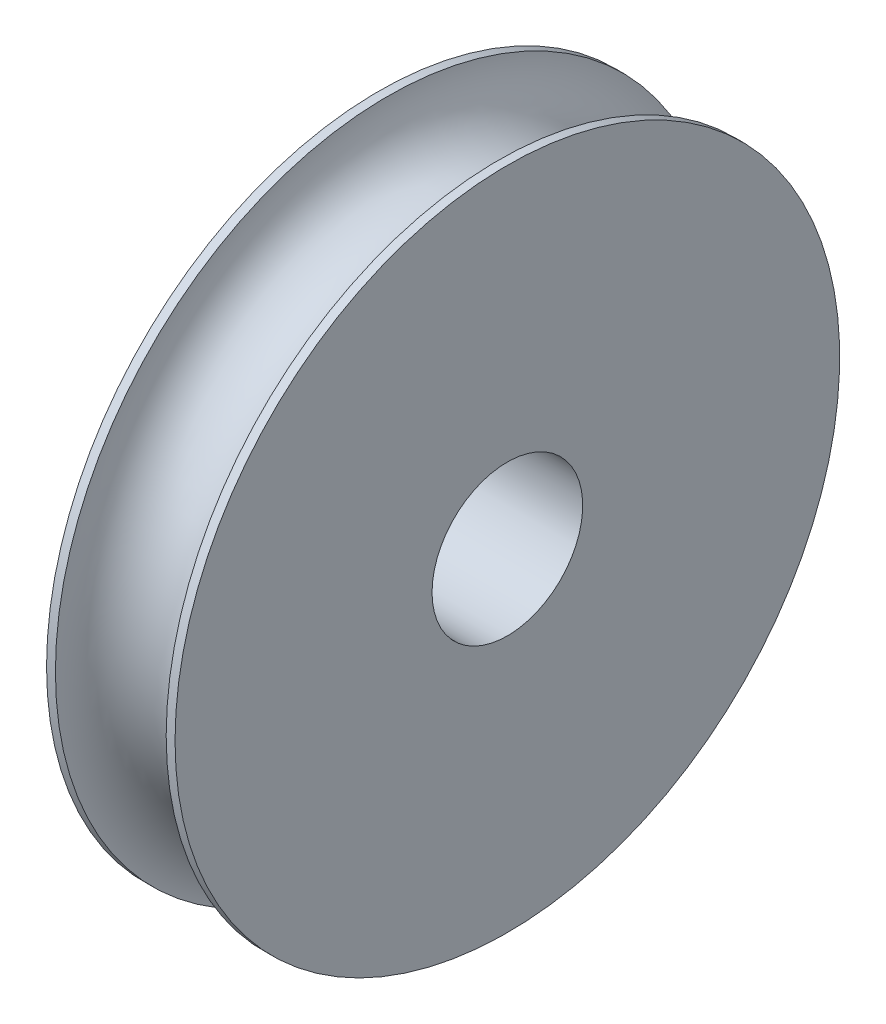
ISO-10303-21;
HEADER;
FILE_DESCRIPTION(('STEP AP214'),'2;1');
FILE_NAME('part.step','',(''),(''),'','','');
FILE_SCHEMA(('AUTOMOTIVE_DESIGN { 1 0 10303 214 1 1 1 1 }'));
ENDSEC;
DATA;
#1=APPLICATION_CONTEXT('core data for automotive mechanical design processes');
#2=APPLICATION_PROTOCOL_DEFINITION('international standard','automotive_design',2000,#1);
#3=PRODUCT_CONTEXT('',#1,'mechanical');
#4=PRODUCT('Part','Part','',(#3));
#5=PRODUCT_RELATED_PRODUCT_CATEGORY('part','',(#4));
#6=PRODUCT_DEFINITION_FORMATION('','',#4);
#7=PRODUCT_DEFINITION_CONTEXT('part definition',#1,'design');
#8=PRODUCT_DEFINITION('design','',#6,#7);
#9=PRODUCT_DEFINITION_SHAPE('','',#8);
#10=(LENGTH_UNIT() NAMED_UNIT(*) SI_UNIT(.MILLI.,.METRE.));
#11=(NAMED_UNIT(*) PLANE_ANGLE_UNIT() SI_UNIT($,.RADIAN.));
#12=(NAMED_UNIT(*) SI_UNIT($,.STERADIAN.) SOLID_ANGLE_UNIT());
#13=UNCERTAINTY_MEASURE_WITH_UNIT(LENGTH_MEASURE(1.E-05),#10,'distance_accuracy_value','');
#14=(GEOMETRIC_REPRESENTATION_CONTEXT(3) GLOBAL_UNCERTAINTY_ASSIGNED_CONTEXT((#13)) GLOBAL_UNIT_ASSIGNED_CONTEXT((#10,
#11,#12)) REPRESENTATION_CONTEXT('',''));
#15=CARTESIAN_POINT('',(0.,0.,0.));
#16=DIRECTION('',(0.,0.,1.));
#17=DIRECTION('',(1.,0.,0.));
#18=AXIS2_PLACEMENT_3D('',#15,#16,#17);
#19=CARTESIAN_POINT('',(0.,0.,0.));
#20=DIRECTION('',(-1.,0.,0.));
#21=DIRECTION('',(0.,0.,1.));
#22=AXIS2_PLACEMENT_3D('',#19,#20,#21);
#23=CYLINDRICAL_SURFACE('',#22,75.);
#24=CARTESIAN_POINT('',(0.,0.,0.));
#25=DIRECTION('',(-1.,0.,0.));
#26=DIRECTION('',(0.,0.,1.));
#27=AXIS2_PLACEMENT_3D('',#24,#25,#26);
#28=CIRCLE('',#27,75.);
#29=CARTESIAN_POINT('',(0.,0.,75.));
#30=VERTEX_POINT('',#29);
#31=EDGE_CURVE('E10',#30,#30,#28,.T.);
#32=ORIENTED_EDGE('',*,*,#31,.F.);
#33=EDGE_LOOP('',(#32));
#34=FACE_BOUND('',#33,.T.);
#35=CARTESIAN_POINT('',(2.,0.,0.));
#36=DIRECTION('',(-1.,0.,0.));
#37=DIRECTION('',(0.,0.,1.));
#38=AXIS2_PLACEMENT_3D('',#35,#36,#37);
#39=CIRCLE('',#38,75.);
#40=CARTESIAN_POINT('',(2.,0.,75.));
#41=VERTEX_POINT('',#40);
#42=EDGE_CURVE('E53',#41,#41,#39,.T.);
#43=ORIENTED_EDGE('',*,*,#42,.T.);
#44=EDGE_LOOP('',(#43));
#45=FACE_BOUND('',#44,.T.);
#46=ADVANCED_FACE('F31',(#34,#45),#23,.T.);
#47=CARTESIAN_POINT('',(0.,17.,0.));
#48=DIRECTION('',(1.,0.,0.));
#49=DIRECTION('',(0.,0.,-1.));
#50=AXIS2_PLACEMENT_3D('',#47,#48,#49);
#51=PLANE('',#50);
#52=CARTESIAN_POINT('',(0.,0.,0.));
#53=DIRECTION('',(-1.,0.,0.));
#54=DIRECTION('',(0.,0.,1.));
#55=AXIS2_PLACEMENT_3D('',#52,#53,#54);
#56=CIRCLE('',#55,17.);
#57=CARTESIAN_POINT('',(0.,0.,17.));
#58=VERTEX_POINT('',#57);
#59=EDGE_CURVE('E37',#58,#58,#56,.T.);
#60=ORIENTED_EDGE('',*,*,#59,.F.);
#61=EDGE_LOOP('',(#60));
#62=FACE_BOUND('',#61,.T.);
#63=ORIENTED_EDGE('',*,*,#31,.T.);
#64=EDGE_LOOP('',(#63));
#65=FACE_BOUND('',#64,.T.);
#66=ADVANCED_FACE('F78',(#62,#65),#51,.F.);
#67=CARTESIAN_POINT('',(0.,0.,0.));
#68=DIRECTION('',(-1.,0.,0.));
#69=DIRECTION('',(0.,0.,1.));
#70=AXIS2_PLACEMENT_3D('',#67,#68,#69);
#71=CYLINDRICAL_SURFACE('',#70,17.);
#72=CARTESIAN_POINT('',(29.,0.,0.));
#73=DIRECTION('',(-1.,0.,0.));
#74=DIRECTION('',(0.,0.,1.));
#75=AXIS2_PLACEMENT_3D('',#72,#73,#74);
#76=CIRCLE('',#75,17.);
#77=CARTESIAN_POINT('',(29.,0.,17.));
#78=VERTEX_POINT('',#77);
#79=EDGE_CURVE('E41',#78,#78,#76,.T.);
#80=ORIENTED_EDGE('',*,*,#79,.F.);
#81=EDGE_LOOP('',(#80));
#82=FACE_BOUND('',#81,.T.);
#83=ORIENTED_EDGE('',*,*,#59,.T.);
#84=EDGE_LOOP('',(#83));
#85=FACE_BOUND('',#84,.T.);
#86=ADVANCED_FACE('F73',(#82,#85),#71,.F.);
#87=CARTESIAN_POINT('',(29.,75.,0.));
#88=DIRECTION('',(-1.,0.,0.));
#89=DIRECTION('',(0.,0.,1.));
#90=AXIS2_PLACEMENT_3D('',#87,#88,#89);
#91=PLANE('',#90);
#92=CARTESIAN_POINT('',(29.,0.,0.));
#93=DIRECTION('',(-1.,0.,0.));
#94=DIRECTION('',(0.,0.,1.));
#95=AXIS2_PLACEMENT_3D('',#92,#93,#94);
#96=CIRCLE('',#95,75.);
#97=CARTESIAN_POINT('',(29.,0.,75.));
#98=VERTEX_POINT('',#97);
#99=EDGE_CURVE('E45',#98,#98,#96,.T.);
#100=ORIENTED_EDGE('',*,*,#99,.F.);
#101=EDGE_LOOP('',(#100));
#102=FACE_BOUND('',#101,.T.);
#103=ORIENTED_EDGE('',*,*,#79,.T.);
#104=EDGE_LOOP('',(#103));
#105=FACE_BOUND('',#104,.T.);
#106=ADVANCED_FACE('F67',(#102,#105),#91,.F.);
#107=CARTESIAN_POINT('',(0.,0.,0.));
#108=DIRECTION('',(-1.,0.,0.));
#109=DIRECTION('',(0.,0.,1.));
#110=AXIS2_PLACEMENT_3D('',#107,#108,#109);
#111=CYLINDRICAL_SURFACE('',#110,75.);
#112=CARTESIAN_POINT('',(27.,0.,0.));
#113=DIRECTION('',(-1.,0.,0.));
#114=DIRECTION('',(0.,0.,1.));
#115=AXIS2_PLACEMENT_3D('',#112,#113,#114);
#116=CIRCLE('',#115,75.);
#117=CARTESIAN_POINT('',(27.,0.,75.));
#118=VERTEX_POINT('',#117);
#119=EDGE_CURVE('E50',#118,#118,#116,.T.);
#120=ORIENTED_EDGE('',*,*,#119,.F.);
#121=EDGE_LOOP('',(#120));
#122=FACE_BOUND('',#121,.T.);
#123=ORIENTED_EDGE('',*,*,#99,.T.);
#124=EDGE_LOOP('',(#123));
#125=FACE_BOUND('',#124,.T.);
#126=ADVANCED_FACE('F61',(#122,#125),#111,.T.);
#127=CARTESIAN_POINT('',(14.5,0.,0.));
#128=DIRECTION('',(-1.,0.,0.));
#129=DIRECTION('',(0.,0.,1.));
#130=AXIS2_PLACEMENT_3D('',#127,#128,#129);
#131=TOROIDAL_SURFACE('',#130,75.,12.5);
#132=ORIENTED_EDGE('',*,*,#42,.F.);
#133=EDGE_LOOP('',(#132));
#134=FACE_BOUND('',#133,.T.);
#135=ORIENTED_EDGE('',*,*,#119,.T.);
#136=EDGE_LOOP('',(#135));
#137=FACE_BOUND('',#136,.T.);
#138=ADVANCED_FACE('F58',(#134,#137),#131,.F.);
#139=CLOSED_SHELL('',(#46,#66,#86,#106,#126,#138));
#140=MANIFOLD_SOLID_BREP('B2',#139);
#141=ADVANCED_BREP_SHAPE_REPRESENTATION('',(#18,#140),#14);
#142=SHAPE_DEFINITION_REPRESENTATION(#9,#141);
ENDSEC;
END-ISO-10303-21;
